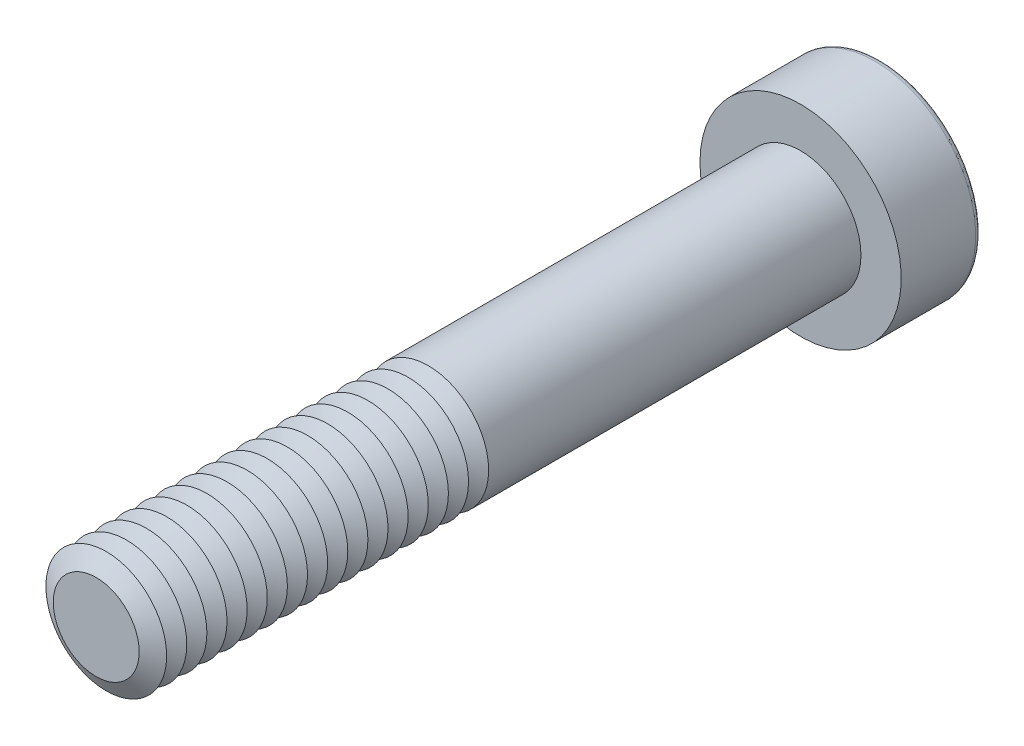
from build123d import *

# Parameters (mm, degrees)
SKETCH1_R           = 3
BOSS_EXTRUDE1_DEPTH = 35
SKETCH2_R           = 5
BOSS_EXTRUDE2_DEPTH = 4
CUT_EXTRUDE1_DEPTH  = 3
FILLET1_R           = 0.3
LPATTERN1_COUNT     = 17
LPATTERN1_PITCH     = 1


with BuildPart() as part:
    # Sketch1 → Boss-Extrude1 (new body)
    with BuildSketch(Plane.XY):
        Circle(SKETCH1_R)
    extrude(amount=BOSS_EXTRUDE1_DEPTH)

    # Sketch2 → Boss-Extrude2 (add)
    with BuildSketch(Plane(origin=(0, 0, 0), x_dir=(-1, 0, 0), z_dir=(0, 0, -1))):
        Circle(SKETCH2_R)
    extrude(amount=BOSS_EXTRUDE2_DEPTH)

    # Sketch3 → Cut-Extrude1 (cut)
    with BuildSketch(Plane(origin=(0, 0, -4), x_dir=(-1, 0, 0), z_dir=(0, 0, -1))):
        Polygon((-1.154700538, 2), (-2.309401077, 0), (-1.154700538, -2), (1.154700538, -2), (2.309401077, 0), (1.154700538, 2), align=None)
    extrude(amount=-CUT_EXTRUDE1_DEPTH, mode=Mode.SUBTRACT)

    # Fillet1
    fillet1_edges = [part.edges().sort_by_distance(p)[0] for p in [
        (5, 0, -4),
    ]]
    fillet(fillet1_edges, radius=FILLET1_R)

    # Cut-Extrude2 cone 1 section (on through the dimple's axis) → Cut-Extrude2 (revolve, cut)
    with BuildSketch(Plane(origin=(0, 0, -1), x_dir=(0, 1, 0), z_dir=(1, 0, 0))):
        Polygon((0, 0), (2, 0), (0, 1.154700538), align=None)
    revolve(axis=Axis((0, 0, -1), (0, 0, 1)), mode=Mode.SUBTRACT)

    # Cut-Extrude3 cone 1 section (on through the dimple's axis) → Cut-Extrude3 (revolve, cut)
    with BuildSketch(Plane(origin=(0, 0, -4), x_dir=(0, 1, 0), z_dir=(1, 0, 0))):
        Polygon((0, 0), (2.309401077, 0), (0, 0.618802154), align=None)
    revolve(axis=Axis((0, 0, -4), (0, 0, 1)), mode=Mode.SUBTRACT)

    # Sketch7 → Cut-Revolve1 (revolve, cut)
    with BuildSketch(Plane(origin=(0, 0, 0), x_dir=(0, 0, -1), z_dir=(1, 0, 0)), mode=Mode.PRIVATE) as cut_revolve1_sk:
        Polygon((-35, 2.133974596), (-34.5, 3), (-35.5, 3), align=None)
    cut_revolve1 = revolve(cut_revolve1_sk.sketch.rotate(Axis((0, 0, 35), (0, 0, -1)), 90), axis=Axis((0, 0, 35), (0, 0, -1)), mode=Mode.SUBTRACT)

    # LPattern1: Cut-Revolve1 ×17
    with Locations(*[(0, 0, -i * LPATTERN1_PITCH) for i in range(1, LPATTERN1_COUNT)]):
        add(cut_revolve1, mode=Mode.SUBTRACT)


solid = part.part
